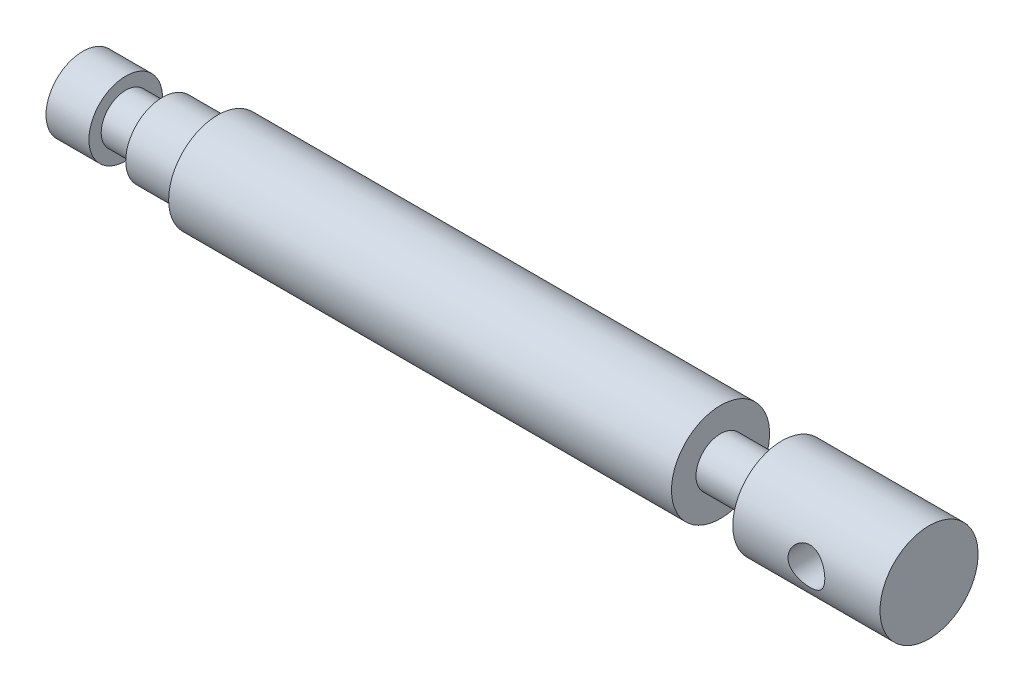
from build123d import *

# Parameters (mm, degrees)
SKETCH2_R      = 3
EXTRUDE1_DEPTH = 15


with BuildPart() as part:
    # Sketch1 → Revolve1 (revolve)
    with BuildSketch(Plane.XY, mode=Mode.PRIVATE) as revolve1_sk:
        Polygon((0, 0), (0, 6), (7, 6), (7, 4), (13, 4), (13, 6), (22, 6), (22, 8), (104, 8), (104, 4), (114, 4), (114, 8), (138, 8), (138, 0), align=None)
    revolve(revolve1_sk.sketch.rotate(Axis((0, 0, 0), (1, 0, 0)), 90), axis=Axis((0, 0, 0), (1, 0, 0)))

    # Sketch2 → Extrude1 (cut, symmetric)
    with BuildSketch(Plane.XY):
        with Locations((126, 0)):
            Circle(SKETCH2_R)
    extrude(amount=EXTRUDE1_DEPTH, both=True, mode=Mode.SUBTRACT)


solid = part.part
